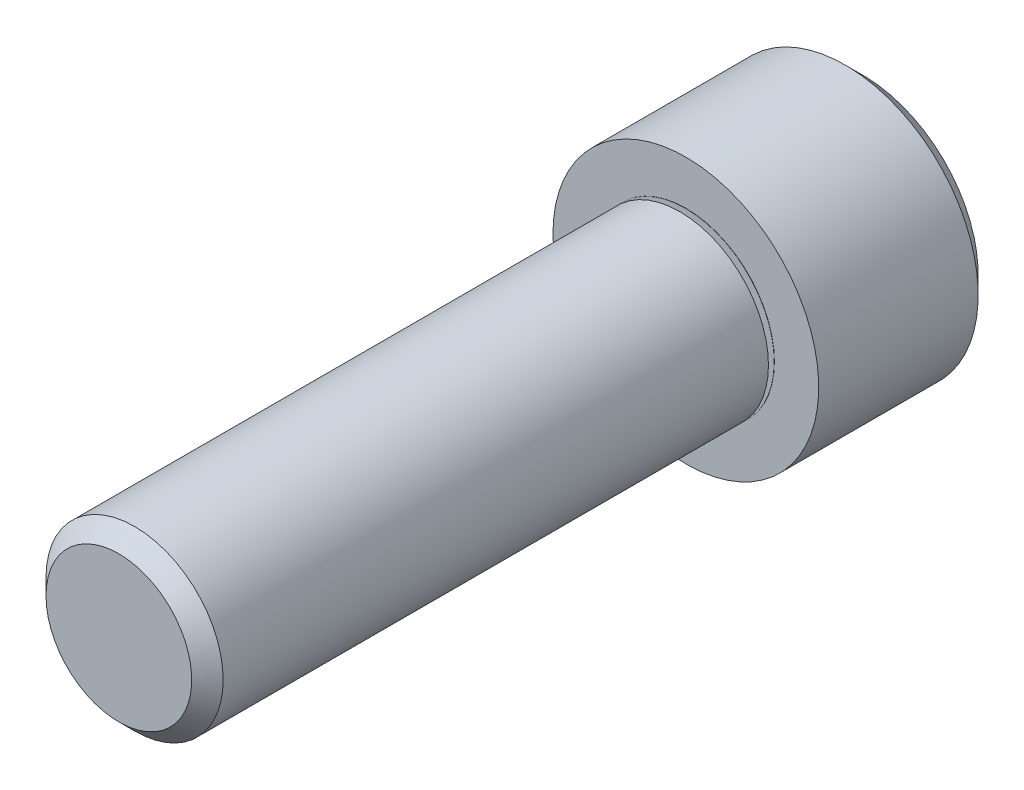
from build123d import *

# Parameters (mm, degrees)
CUT_EXTRUDE1_DEPTH = 3.96875


with BuildPart() as part:
    # Logo3_bib1 → Revolve1 (revolve)
    with BuildSketch(Plane(origin=(0, 0, 0), x_dir=(-1, 0, 0), z_dir=(0, -1, 0))):
        with BuildLine():
            Line((0, -25.4), (0, 7.9375))
            Line((0, 7.9375), (5.159375, 7.9375))
            Line((5.159375, 7.9375), (5.953125, 7.14375))
            Line((5.953125, 7.14375), (5.953125, 0))
            Line((5.953125, 0), (3.96875, 0))
            Line((3.96875, 0), (3.96875, -0.01))
            Line((3.96875, -0.01), (3.377325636, -0.01))
            ThreePointArc((3.377325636, -0.01), (3.357629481, -0.026527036), (3.370485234, -0.048793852))
            Line((3.370485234, -0.048793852), (3.96875, -0.26654442))
            Line((3.96875, -0.26654442), (3.96875, -24.69515))
            Line((3.96875, -24.69515), (3.2639, -25.4))
            Line((3.2639, -25.4), (0, -25.4))
        make_face()
    revolve(axis=Axis((0, 0, -10.585154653), (0, 0, 1)))

    # Logo3_bib2 → Cut-Extrude1 (cut)
    with BuildSketch(Plane(origin=(0, 0, -7.9375), x_dir=(1, 0, 0), z_dir=(0, 0, -1))):
        Polygon((3.666174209, 0), (1.833087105, 3.175), (-1.833087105, 3.175), (-3.666174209, 0), (-1.833087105, -3.175), (1.833087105, -3.175), align=None)
    extrude(amount=-CUT_EXTRUDE1_DEPTH, mode=Mode.SUBTRACT)


solid = part.part
